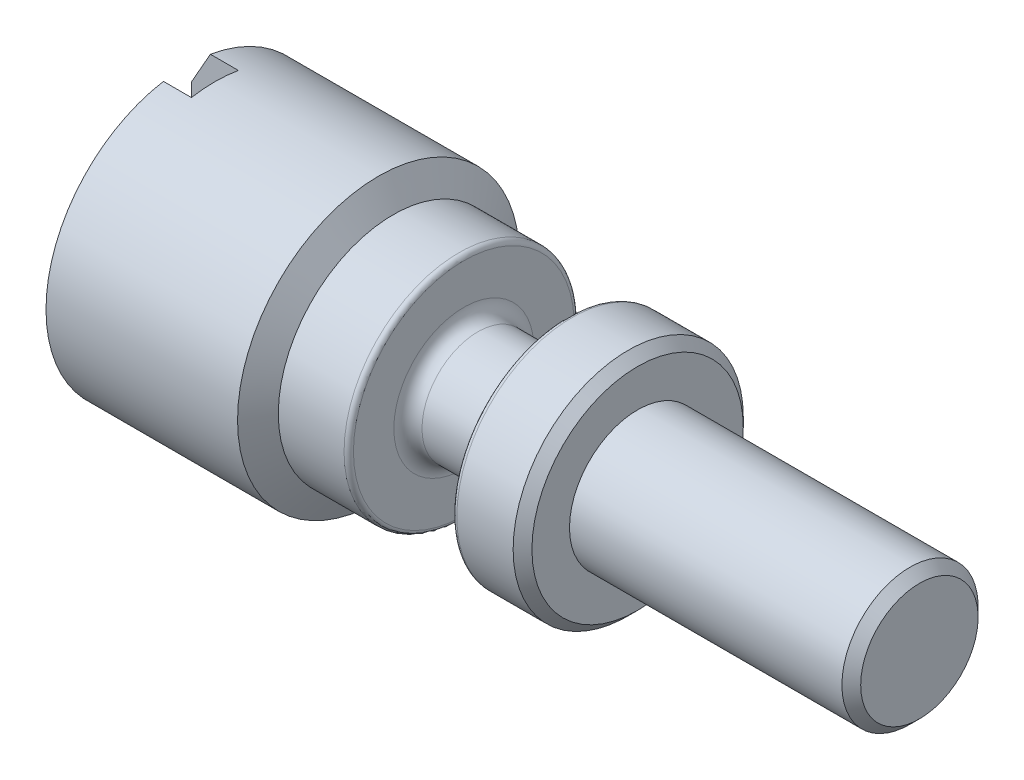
ISO-10303-21;
HEADER;
FILE_DESCRIPTION(('STEP AP214'),'2;1');
FILE_NAME('part.step','',(''),(''),'','','');
FILE_SCHEMA(('AUTOMOTIVE_DESIGN { 1 0 10303 214 1 1 1 1 }'));
ENDSEC;
DATA;
#1=APPLICATION_CONTEXT('core data for automotive mechanical design processes');
#2=APPLICATION_PROTOCOL_DEFINITION('international standard','automotive_design',2000,#1);
#3=PRODUCT_CONTEXT('',#1,'mechanical');
#4=PRODUCT('Part','Part','',(#3));
#5=PRODUCT_RELATED_PRODUCT_CATEGORY('part','',(#4));
#6=PRODUCT_DEFINITION_FORMATION('','',#4);
#7=PRODUCT_DEFINITION_CONTEXT('part definition',#1,'design');
#8=PRODUCT_DEFINITION('design','',#6,#7);
#9=PRODUCT_DEFINITION_SHAPE('','',#8);
#10=(LENGTH_UNIT() NAMED_UNIT(*) SI_UNIT(.MILLI.,.METRE.));
#11=(NAMED_UNIT(*) PLANE_ANGLE_UNIT() SI_UNIT($,.RADIAN.));
#12=(NAMED_UNIT(*) SI_UNIT($,.STERADIAN.) SOLID_ANGLE_UNIT());
#13=UNCERTAINTY_MEASURE_WITH_UNIT(LENGTH_MEASURE(1.E-05),#10,'distance_accuracy_value','');
#14=(GEOMETRIC_REPRESENTATION_CONTEXT(3) GLOBAL_UNCERTAINTY_ASSIGNED_CONTEXT((#13)) GLOBAL_UNIT_ASSIGNED_CONTEXT((#10,
#11,#12)) REPRESENTATION_CONTEXT('',''));
#15=CARTESIAN_POINT('',(0.,0.,0.));
#16=DIRECTION('',(0.,0.,1.));
#17=DIRECTION('',(1.,0.,0.));
#18=AXIS2_PLACEMENT_3D('',#15,#16,#17);
#19=CARTESIAN_POINT('',(0.,2.3,0.));
#20=DIRECTION('',(1.,0.,0.));
#21=DIRECTION('',(0.,0.,-1.00000000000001));
#22=AXIS2_PLACEMENT_3D('',#19,#20,#21);
#23=PLANE('',#22);
#24=CARTESIAN_POINT('',(0.,0.,0.));
#25=DIRECTION('',(-1.,0.,0.));
#26=DIRECTION('',(0.,0.,1.00000000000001));
#27=AXIS2_PLACEMENT_3D('',#24,#25,#26);
#28=CIRCLE('',#27,2.3);
#29=CARTESIAN_POINT('',(0.,2.24499443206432,-0.500000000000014));
#30=VERTEX_POINT('',#29);
#31=CARTESIAN_POINT('',(0.,-2.24499443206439,-0.5));
#32=VERTEX_POINT('',#31);
#33=EDGE_CURVE('E107',#30,#32,#28,.T.);
#34=ORIENTED_EDGE('',*,*,#33,.T.);
#35=DIRECTION('',(0.,1.00000000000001,0.));
#36=VECTOR('',#35,1.);
#37=CARTESIAN_POINT('',(0.,-4.50000000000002,-0.500000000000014));
#38=LINE('',#37,#36);
#39=EDGE_CURVE('E99',#32,#30,#38,.T.);
#40=ORIENTED_EDGE('',*,*,#39,.T.);
#41=EDGE_LOOP('',(#34,#40));
#42=FACE_BOUND('',#41,.T.);
#43=ADVANCED_FACE('F36',(#42),#23,.F.);
#44=CARTESIAN_POINT('',(0.40414518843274,0.,0.));
#45=DIRECTION('',(1.,0.,0.));
#46=DIRECTION('',(0.,0.,-1.00000000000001));
#47=AXIS2_PLACEMENT_3D('',#44,#45,#46);
#48=CONICAL_SURFACE('',#47,3.,1.0471975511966);
#49=CARTESIAN_POINT('',(0.40414518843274,0.,0.));
#50=DIRECTION('',(-1.,0.,0.));
#51=DIRECTION('',(0.,0.,1.00000000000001));
#52=AXIS2_PLACEMENT_3D('',#49,#50,#51);
#53=CIRCLE('',#52,3.);
#54=CARTESIAN_POINT('',(0.40414518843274,2.95803989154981,-0.5));
#55=VERTEX_POINT('',#54);
#56=CARTESIAN_POINT('',(0.40414518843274,-2.95803989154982,-0.5));
#57=VERTEX_POINT('',#56);
#58=EDGE_CURVE('E108',#55,#57,#53,.T.);
#59=ORIENTED_EDGE('',*,*,#58,.T.);
#60=CARTESIAN_POINT('',(2.4983365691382,-6.60835742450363,-0.5));
#61=CARTESIAN_POINT('',(2.33754994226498,-6.32905650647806,-0.500000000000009));
#62=CARTESIAN_POINT('',(2.17679546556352,-6.04973702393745,-0.500000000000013));
#63=CARTESIAN_POINT('',(1.85541884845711,-5.49101933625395,-0.500000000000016));
#64=CARTESIAN_POINT('',(1.69479670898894,-5.21162113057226,-0.500000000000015));
#65=CARTESIAN_POINT('',(1.37362738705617,-4.65248605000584,-0.500000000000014));
#66=CARTESIAN_POINT('',(1.21308036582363,-4.37274908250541,-0.500000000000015));
#67=CARTESIAN_POINT('',(0.892332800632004,-3.81307851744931,-0.500000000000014));
#68=CARTESIAN_POINT('',(0.732132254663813,-3.53314492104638,-0.500000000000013));
#69=CARTESIAN_POINT('',(0.492929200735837,-3.11396046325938,-0.500000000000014));
#70=CARTESIAN_POINT('',(0.413665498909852,-2.97485868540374,-0.500000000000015));
#71=CARTESIAN_POINT('',(0.255397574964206,-2.69650513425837,-0.500000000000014));
#72=CARTESIAN_POINT('',(0.176393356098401,-2.55725335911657,-0.500000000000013));
#73=CARTESIAN_POINT('',(0.0188328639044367,-2.27857581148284,-0.500000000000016));
#74=CARTESIAN_POINT('',(-0.0597235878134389,-2.13915013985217,-0.50000000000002));
#75=CARTESIAN_POINT('',(-0.216137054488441,-1.85991156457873,-0.500000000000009));
#76=CARTESIAN_POINT('',(-0.293994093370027,-1.72009867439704,-0.499999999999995));
#77=CARTESIAN_POINT('',(-0.409961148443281,-1.50940543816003,-0.500000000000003));
#78=CARTESIAN_POINT('',(-0.448588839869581,-1.43881034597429,-0.500000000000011));
#79=CARTESIAN_POINT('',(-0.525315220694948,-1.29732475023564,-0.500000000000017));
#80=CARTESIAN_POINT('',(-0.563413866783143,-1.2264342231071,-0.500000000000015));
#81=CARTESIAN_POINT('',(-0.63881726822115,-1.08412531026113,-0.500000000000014));
#82=CARTESIAN_POINT('',(-0.676121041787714,-1.01270640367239,-0.500000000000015));
#83=CARTESIAN_POINT('',(-0.749323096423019,-0.869156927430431,-0.500000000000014));
#84=CARTESIAN_POINT('',(-0.785221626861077,-0.797026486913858,-0.500000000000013));
#85=CARTESIAN_POINT('',(-0.837549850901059,-0.686867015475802,-0.500000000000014));
#86=CARTESIAN_POINT('',(-0.854960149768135,-0.649306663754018,-0.500000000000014));
#87=CARTESIAN_POINT('',(-0.888745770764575,-0.573725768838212,-0.500000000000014));
#88=CARTESIAN_POINT('',(-0.905121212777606,-0.535705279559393,-0.500000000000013));
#89=CARTESIAN_POINT('',(-0.936339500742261,-0.459031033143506,-0.500000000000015));
#90=CARTESIAN_POINT('',(-0.951182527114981,-0.420377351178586,-0.500000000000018));
#91=CARTESIAN_POINT('',(-0.978536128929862,-0.342270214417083,-0.500000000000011));
#92=CARTESIAN_POINT('',(-0.991047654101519,-0.302817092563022,-0.500000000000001));
#93=CARTESIAN_POINT('',(-1.01648208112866,-0.208025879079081,-0.499999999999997));
#94=CARTESIAN_POINT('',(-1.02784152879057,-0.152215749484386,-0.500000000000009));
#95=CARTESIAN_POINT('',(-1.03702258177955,-0.0678306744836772,-0.500000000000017));
#96=CARTESIAN_POINT('',(-1.03878028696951,-0.0396852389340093,-0.500000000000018));
#97=CARTESIAN_POINT('',(-1.03952744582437,0.0166440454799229,-0.50000000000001));
#98=CARTESIAN_POINT('',(-1.03851695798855,0.0448278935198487,-0.500000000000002));
#99=CARTESIAN_POINT('',(-1.03321049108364,0.10852531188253,-0.499999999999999));
#100=CARTESIAN_POINT('',(-1.02810354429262,0.143970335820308,-0.50000000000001));
#101=CARTESIAN_POINT('',(-1.01444226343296,0.214196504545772,-0.500000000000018));
#102=CARTESIAN_POINT('',(-1.00588391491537,0.248976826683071,-0.500000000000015));
#103=CARTESIAN_POINT('',(-0.986157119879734,0.318273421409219,-0.500000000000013));
#104=CARTESIAN_POINT('',(-0.974955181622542,0.352779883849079,-0.500000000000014));
#105=CARTESIAN_POINT('',(-0.950795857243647,0.421147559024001,-0.500000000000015));
#106=CARTESIAN_POINT('',(-0.937839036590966,0.455008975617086,-0.500000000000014));
#107=CARTESIAN_POINT('',(-0.909399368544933,0.525488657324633,-0.500000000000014));
#108=CARTESIAN_POINT('',(-0.893793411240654,0.562056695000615,-0.500000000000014));
#109=CARTESIAN_POINT('',(-0.86158242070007,0.634752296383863,-0.500000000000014));
#110=CARTESIAN_POINT('',(-0.844977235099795,0.670879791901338,-0.500000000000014));
#111=CARTESIAN_POINT('',(-0.794117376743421,0.778807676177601,-0.500000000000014));
#112=CARTESIAN_POINT('',(-0.758832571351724,0.850120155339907,-0.500000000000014));
#113=CARTESIAN_POINT('',(-0.686767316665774,0.992116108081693,-0.500000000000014));
#114=CARTESIAN_POINT('',(-0.649984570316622,1.06279839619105,-0.500000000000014));
#115=CARTESIAN_POINT('',(-0.575565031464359,1.203684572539,-0.500000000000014));
#116=CARTESIAN_POINT('',(-0.537928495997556,1.27388859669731,-0.500000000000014));
#117=CARTESIAN_POINT('',(-0.462314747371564,1.41362256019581,-0.500000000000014));
#118=CARTESIAN_POINT('',(-0.424340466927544,1.48315409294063,-0.500000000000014));
#119=CARTESIAN_POINT('',(-0.348023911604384,1.6220216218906,-0.500000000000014));
#120=CARTESIAN_POINT('',(-0.309681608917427,1.69135760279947,-0.500000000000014));
#121=CARTESIAN_POINT('',(-0.19435235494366,1.8990197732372,-0.500000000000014));
#122=CARTESIAN_POINT('',(-0.116988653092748,2.03713648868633,-0.500000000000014));
#123=CARTESIAN_POINT('',(0.0647759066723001,2.36016715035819,-0.500000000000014));
#124=CARTESIAN_POINT('',(0.169390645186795,2.54496043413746,-0.500000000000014));
#125=CARTESIAN_POINT('',(0.37912439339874,2.91426301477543,-0.500000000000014));
#126=CARTESIAN_POINT('',(0.484243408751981,3.09877230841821,-0.500000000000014));
#127=CARTESIAN_POINT('',(0.800118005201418,3.65220737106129,-0.500000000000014));
#128=CARTESIAN_POINT('',(1.0113043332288,4.02088713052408,-0.500000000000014));
#129=CARTESIAN_POINT('',(1.43503208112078,4.75953035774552,-0.500000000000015));
#130=CARTESIAN_POINT('',(1.64757546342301,5.12949269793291,-0.500000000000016));
#131=CARTESIAN_POINT('',(2.07284454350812,5.86909697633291,-0.500000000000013));
#132=CARTESIAN_POINT('',(2.28557012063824,6.2387389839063,-0.50000000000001));
#133=CARTESIAN_POINT('',(2.4983365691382,6.60835742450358,-0.500000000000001));
#134=B_SPLINE_CURVE_WITH_KNOTS('',3,(#60,#61,#62,#63,#64,#65,#66,#67,#68,#69,#70,#71,#72,#73,
#74,#75,#76,#77,#78,#79,#80,#81,#82,#83,#84,#85,#86,#87,#88,#89,#90,#91,#92,#93,#94,#95,#96,#97,
#98,#99,#100,#101,#102,#103,#104,#105,#106,#107,#108,#109,#110,#111,#112,#113,#114,#115,#116,
#117,#118,#119,#120,#121,#122,#123,#124,#125,#126,#127,#128,#129,#130,#131,#132,#133),
.UNSPECIFIED.,.F.,.F.,(4,2,2,2,2,2,2,2,2,2,2,2,2,2,2,2,2,2,2,2,2,2,2,2,2,2,2,2,2,2,2,2,2,2,2,2,
4),(0.,0.966825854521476,1.93365849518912,2.90126013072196,3.86885614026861,4.34915627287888,
4.82946240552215,5.30956152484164,5.78964415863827,6.03105935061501,6.27249419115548,
6.51421172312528,6.75588616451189,6.88007299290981,7.00424540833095,7.12840318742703,
7.25251028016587,7.42257675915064,7.50705075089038,7.59152295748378,7.69872713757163,
7.80605637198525,7.91482621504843,8.02356109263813,8.14281580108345,8.26208873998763,
8.50074311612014,8.73977836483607,8.97874258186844,9.21641780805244,9.45411113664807,
9.92903195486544,10.5660826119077,11.2031404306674,12.477784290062,13.7577926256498,
15.0372402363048),.UNSPECIFIED.);
#135=EDGE_CURVE('E59',#57,#32,#134,.T.);
#136=ORIENTED_EDGE('',*,*,#135,.T.);
#137=ORIENTED_EDGE('',*,*,#33,.F.);
#138=EDGE_CURVE('E255',#30,#55,#134,.T.);
#139=ORIENTED_EDGE('',*,*,#138,.T.);
#140=EDGE_LOOP('',(#59,#136,#137,#139));
#141=FACE_BOUND('',#140,.T.);
#142=ADVANCED_FACE('F173',(#141),#48,.T.);
#143=CARTESIAN_POINT('',(-5.4550241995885,0.,0.));
#144=DIRECTION('',(-1.,0.,0.));
#145=DIRECTION('',(0.,0.,1.00000000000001));
#146=AXIS2_PLACEMENT_3D('',#143,#144,#145);
#147=CYLINDRICAL_SURFACE('',#146,1.45);
#148=CARTESIAN_POINT('',(15.8,0.,0.));
#149=DIRECTION('',(-1.,0.,0.));
#150=DIRECTION('',(0.,0.,1.00000000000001));
#151=AXIS2_PLACEMENT_3D('',#148,#149,#150);
#152=CIRCLE('',#151,1.45);
#153=CARTESIAN_POINT('',(15.8,0.,1.45000000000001));
#154=VERTEX_POINT('',#153);
#155=EDGE_CURVE('E111',#154,#154,#152,.T.);
#156=ORIENTED_EDGE('',*,*,#155,.T.);
#157=EDGE_LOOP('',(#156));
#158=FACE_BOUND('',#157,.T.);
#159=CARTESIAN_POINT('',(10.,0.,0.));
#160=DIRECTION('',(-1.,0.,0.));
#161=DIRECTION('',(0.,0.,1.00000000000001));
#162=AXIS2_PLACEMENT_3D('',#159,#160,#161);
#163=CIRCLE('',#162,1.45);
#164=CARTESIAN_POINT('',(10.,0.,1.45000000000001));
#165=VERTEX_POINT('',#164);
#166=EDGE_CURVE('E261',#165,#165,#163,.T.);
#167=ORIENTED_EDGE('',*,*,#166,.F.);
#168=EDGE_LOOP('',(#167));
#169=FACE_BOUND('',#168,.T.);
#170=ADVANCED_FACE('F179',(#158,#169),#147,.T.);
#171=CARTESIAN_POINT('',(16.,1.44999999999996,0.));
#172=DIRECTION('',(-1.,0.,0.));
#173=DIRECTION('',(0.,0.,1.00000000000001));
#174=AXIS2_PLACEMENT_3D('',#171,#172,#173);
#175=PLANE('',#174);
#176=CARTESIAN_POINT('',(16.,0.,0.));
#177=DIRECTION('',(-1.,0.,0.));
#178=DIRECTION('',(0.,0.,1.00000000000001));
#179=AXIS2_PLACEMENT_3D('',#176,#177,#178);
#180=CIRCLE('',#179,1.25);
#181=CARTESIAN_POINT('',(16.,0.,1.25000000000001));
#182=VERTEX_POINT('',#181);
#183=EDGE_CURVE('E119',#182,#182,#180,.F.);
#184=ORIENTED_EDGE('',*,*,#183,.T.);
#185=EDGE_LOOP('',(#184));
#186=FACE_BOUND('',#185,.T.);
#187=ADVANCED_FACE('F184',(#186),#175,.F.);
#188=CARTESIAN_POINT('',(0.,-2.24499443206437,0.500000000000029));
#189=VERTEX_POINT('',#188);
#190=CARTESIAN_POINT('',(0.,2.24499443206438,0.500000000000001));
#191=VERTEX_POINT('',#190);
#192=EDGE_CURVE('E104',#189,#191,#28,.T.);
#193=ORIENTED_EDGE('',*,*,#192,.T.);
#194=DIRECTION('',(0.,1.00000000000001,0.));
#195=VECTOR('',#194,1.);
#196=CARTESIAN_POINT('',(0.,-4.50000000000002,0.500000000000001));
#197=LINE('',#196,#195);
#198=EDGE_CURVE('E90',#189,#191,#197,.T.);
#199=ORIENTED_EDGE('',*,*,#198,.F.);
#200=EDGE_LOOP('',(#193,#199));
#201=FACE_BOUND('',#200,.T.);
#202=ADVANCED_FACE('F103',(#201),#23,.F.);
#203=CARTESIAN_POINT('',(0.40414518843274,-2.95803989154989,0.500000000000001));
#204=VERTEX_POINT('',#203);
#205=CARTESIAN_POINT('',(0.40414518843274,2.95803989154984,0.500000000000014));
#206=VERTEX_POINT('',#205);
#207=EDGE_CURVE('E113',#204,#206,#53,.T.);
#208=ORIENTED_EDGE('',*,*,#207,.T.);
#209=CARTESIAN_POINT('',(2.4983365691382,6.60835742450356,0.500000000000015));
#210=CARTESIAN_POINT('',(2.33754994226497,6.329056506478,0.500000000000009));
#211=CARTESIAN_POINT('',(2.1767954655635,6.04973702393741,0.500000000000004));
#212=CARTESIAN_POINT('',(1.85541884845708,5.49101933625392,0.499999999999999));
#213=CARTESIAN_POINT('',(1.69479670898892,5.21162113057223,0.499999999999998));
#214=CARTESIAN_POINT('',(1.37362738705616,4.65248605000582,0.500000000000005));
#215=CARTESIAN_POINT('',(1.21308036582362,4.37274908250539,0.500000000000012));
#216=CARTESIAN_POINT('',(0.892332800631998,3.81307851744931,0.499999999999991));
#217=CARTESIAN_POINT('',(0.732132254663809,3.53314492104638,0.499999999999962));
#218=CARTESIAN_POINT('',(0.492929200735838,3.11396046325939,0.49999999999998));
#219=CARTESIAN_POINT('',(0.413665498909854,2.97485868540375,0.499999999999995));
#220=CARTESIAN_POINT('',(0.255397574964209,2.69650513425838,0.500000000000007));
#221=CARTESIAN_POINT('',(0.176393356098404,2.55725335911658,0.500000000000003));
#222=CARTESIAN_POINT('',(0.0188328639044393,2.27857581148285,0.5));
#223=CARTESIAN_POINT('',(-0.0597235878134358,2.13915013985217,0.500000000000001));
#224=CARTESIAN_POINT('',(-0.216137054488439,1.85991156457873,0.500000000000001));
#225=CARTESIAN_POINT('',(-0.293994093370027,1.72009867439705,0.5));
#226=CARTESIAN_POINT('',(-0.40996114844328,1.50940543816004,0.500000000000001));
#227=CARTESIAN_POINT('',(-0.448588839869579,1.4388103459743,0.500000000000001));
#228=CARTESIAN_POINT('',(-0.525315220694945,1.29732475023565,0.500000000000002));
#229=CARTESIAN_POINT('',(-0.56341386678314,1.22643422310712,0.500000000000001));
#230=CARTESIAN_POINT('',(-0.638817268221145,1.08412531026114,0.500000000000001));
#231=CARTESIAN_POINT('',(-0.676121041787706,1.01270640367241,0.500000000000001));
#232=CARTESIAN_POINT('',(-0.749323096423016,0.869156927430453,0.500000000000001));
#233=CARTESIAN_POINT('',(-0.78522162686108,0.797026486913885,0.500000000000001));
#234=CARTESIAN_POINT('',(-0.837549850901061,0.686867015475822,0.500000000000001));
#235=CARTESIAN_POINT('',(-0.854960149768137,0.649306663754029,0.500000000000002));
#236=CARTESIAN_POINT('',(-0.88874577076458,0.573725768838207,0.500000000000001));
#237=CARTESIAN_POINT('',(-0.905121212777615,0.535705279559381,0.5));
#238=CARTESIAN_POINT('',(-0.93633950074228,0.45903103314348,0.500000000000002));
#239=CARTESIAN_POINT('',(-0.951182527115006,0.420377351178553,0.500000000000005));
#240=CARTESIAN_POINT('',(-0.978536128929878,0.34227021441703,0.499999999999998));
#241=CARTESIAN_POINT('',(-0.991047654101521,0.302817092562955,0.499999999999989));
#242=CARTESIAN_POINT('',(-1.01648208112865,0.208025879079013,0.499999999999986));
#243=CARTESIAN_POINT('',(-1.02784152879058,0.152215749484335,0.499999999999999));
#244=CARTESIAN_POINT('',(-1.03702258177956,0.0678306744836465,0.500000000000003));
#245=CARTESIAN_POINT('',(-1.03878028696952,0.0396852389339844,0.500000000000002));
#246=CARTESIAN_POINT('',(-1.03952744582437,-0.0166440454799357,0.500000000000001));
#247=CARTESIAN_POINT('',(-1.03851695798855,-0.044827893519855,0.500000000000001));
#248=CARTESIAN_POINT('',(-1.03321049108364,-0.108525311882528,0.500000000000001));
#249=CARTESIAN_POINT('',(-1.02810354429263,-0.143970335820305,0.500000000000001));
#250=CARTESIAN_POINT('',(-1.01444226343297,-0.214196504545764,0.500000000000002));
#251=CARTESIAN_POINT('',(-1.00588391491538,-0.248976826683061,0.500000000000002));
#252=CARTESIAN_POINT('',(-0.986157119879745,-0.318273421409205,0.5));
#253=CARTESIAN_POINT('',(-0.974955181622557,-0.352779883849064,0.499999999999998));
#254=CARTESIAN_POINT('',(-0.950795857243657,-0.42114755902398,0.500000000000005));
#255=CARTESIAN_POINT('',(-0.937839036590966,-0.45500897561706,0.500000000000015));
#256=CARTESIAN_POINT('',(-0.909399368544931,-0.525488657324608,0.500000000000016));
#257=CARTESIAN_POINT('',(-0.893793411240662,-0.562056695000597,0.500000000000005));
#258=CARTESIAN_POINT('',(-0.861582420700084,-0.634752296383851,0.499999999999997));
#259=CARTESIAN_POINT('',(-0.844977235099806,-0.670879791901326,0.5));
#260=CARTESIAN_POINT('',(-0.794117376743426,-0.778807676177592,0.500000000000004));
#261=CARTESIAN_POINT('',(-0.758832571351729,-0.850120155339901,0.500000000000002));
#262=CARTESIAN_POINT('',(-0.686767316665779,-0.992116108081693,0.500000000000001));
#263=CARTESIAN_POINT('',(-0.649984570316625,-1.06279839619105,0.500000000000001));
#264=CARTESIAN_POINT('',(-0.575565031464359,-1.20368457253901,0.500000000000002));
#265=CARTESIAN_POINT('',(-0.537928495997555,-1.27388859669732,0.500000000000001));
#266=CARTESIAN_POINT('',(-0.462314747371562,-1.41362256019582,0.500000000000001));
#267=CARTESIAN_POINT('',(-0.42434046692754,-1.48315409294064,0.500000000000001));
#268=CARTESIAN_POINT('',(-0.348023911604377,-1.62202162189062,0.500000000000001));
#269=CARTESIAN_POINT('',(-0.309681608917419,-1.69135760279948,0.500000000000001));
#270=CARTESIAN_POINT('',(-0.194352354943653,-1.89901977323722,0.500000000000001));
#271=CARTESIAN_POINT('',(-0.116988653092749,-2.03713648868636,0.500000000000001));
#272=CARTESIAN_POINT('',(0.0647759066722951,-2.36016715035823,0.500000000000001));
#273=CARTESIAN_POINT('',(0.169390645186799,-2.54496043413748,0.500000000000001));
#274=CARTESIAN_POINT('',(0.379124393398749,-2.91426301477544,0.500000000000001));
#275=CARTESIAN_POINT('',(0.484243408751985,-3.09877230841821,0.500000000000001));
#276=CARTESIAN_POINT('',(0.800118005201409,-3.65220737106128,0.500000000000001));
#277=CARTESIAN_POINT('',(1.01130433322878,-4.02088713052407,0.500000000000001));
#278=CARTESIAN_POINT('',(1.43503208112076,-4.7595303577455,0.500000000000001));
#279=CARTESIAN_POINT('',(1.647575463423,-5.12949269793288,0.500000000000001));
#280=CARTESIAN_POINT('',(2.07284454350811,-5.86909697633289,0.500000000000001));
#281=CARTESIAN_POINT('',(2.28557012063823,-6.23873898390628,0.500000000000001));
#282=CARTESIAN_POINT('',(2.4983365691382,-6.60835742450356,0.500000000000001));
#283=B_SPLINE_CURVE_WITH_KNOTS('',3,(#209,#210,#211,#212,#213,#214,#215,#216,#217,#218,#219,
#220,#221,#222,#223,#224,#225,#226,#227,#228,#229,#230,#231,#232,#233,#234,#235,#236,#237,#238,
#239,#240,#241,#242,#243,#244,#245,#246,#247,#248,#249,#250,#251,#252,#253,#254,#255,#256,#257,
#258,#259,#260,#261,#262,#263,#264,#265,#266,#267,#268,#269,#270,#271,#272,#273,#274,#275,#276,
#277,#278,#279,#280,#281,#282),.UNSPECIFIED.,.F.,.F.,(4,2,2,2,2,2,2,2,2,2,2,2,2,2,2,2,2,2,2,2,2,
2,2,2,2,2,2,2,2,2,2,2,2,2,2,2,4),(0.,0.966825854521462,1.9336584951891,2.90126013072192,
3.86885614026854,4.34915627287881,4.82946240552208,5.30956152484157,5.78964415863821,
6.03105935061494,6.27249419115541,6.5142117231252,6.75588616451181,6.88007299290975,
7.00424540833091,7.12840318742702,7.25251028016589,7.42257675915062,7.50705075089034,
7.59152295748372,7.69872713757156,7.80605637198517,7.91482621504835,8.02356109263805,
8.14281580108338,8.26208873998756,8.50074311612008,8.73977836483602,8.9787425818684,
9.21641780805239,9.45411113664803,9.92903195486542,10.5660826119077,11.2031404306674,
12.4777842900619,13.7577926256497,15.0372402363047),.UNSPECIFIED.);
#284=EDGE_CURVE('E98',#206,#191,#283,.T.);
#285=ORIENTED_EDGE('',*,*,#284,.T.);
#286=ORIENTED_EDGE('',*,*,#192,.F.);
#287=EDGE_CURVE('E87',#189,#204,#283,.T.);
#288=ORIENTED_EDGE('',*,*,#287,.T.);
#289=EDGE_LOOP('',(#208,#285,#286,#288));
#290=FACE_BOUND('',#289,.T.);
#291=ADVANCED_FACE('F106',(#290),#48,.T.);
#292=CARTESIAN_POINT('',(-5.4550241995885,0.,0.));
#293=DIRECTION('',(-1.,0.,0.));
#294=DIRECTION('',(0.,0.,1.00000000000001));
#295=AXIS2_PLACEMENT_3D('',#292,#293,#294);
#296=CYLINDRICAL_SURFACE('',#295,3.);
#297=ORIENTED_EDGE('',*,*,#58,.F.);
#298=DIRECTION('',(-1.,0.,0.));
#299=VECTOR('',#298,1.);
#300=CARTESIAN_POINT('',(-5.4550241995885,2.95803989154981,-0.5));
#301=LINE('',#300,#299);
#302=CARTESIAN_POINT('',(1.,2.95803989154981,-0.5));
#303=VERTEX_POINT('',#302);
#304=EDGE_CURVE('E150',#55,#303,#301,.F.);
#305=ORIENTED_EDGE('',*,*,#304,.T.);
#306=CARTESIAN_POINT('',(1.,0.,0.));
#307=DIRECTION('',(1.,0.,0.));
#308=DIRECTION('',(0.,0.,-1.00000000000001));
#309=AXIS2_PLACEMENT_3D('',#306,#307,#308);
#310=CIRCLE('',#309,3.);
#311=CARTESIAN_POINT('',(1.,2.95803989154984,0.500000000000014));
#312=VERTEX_POINT('',#311);
#313=EDGE_CURVE('E145',#303,#312,#310,.T.);
#314=ORIENTED_EDGE('',*,*,#313,.T.);
#315=DIRECTION('',(-1.,0.,0.));
#316=VECTOR('',#315,1.);
#317=CARTESIAN_POINT('',(-5.4550241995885,2.95803989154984,0.500000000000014));
#318=LINE('',#317,#316);
#319=EDGE_CURVE('E147',#312,#206,#318,.T.);
#320=ORIENTED_EDGE('',*,*,#319,.T.);
#321=ORIENTED_EDGE('',*,*,#207,.F.);
#322=DIRECTION('',(-1.,0.,0.));
#323=VECTOR('',#322,1.);
#324=CARTESIAN_POINT('',(-5.4550241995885,-2.95803989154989,0.500000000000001));
#325=LINE('',#324,#323);
#326=CARTESIAN_POINT('',(1.,-2.95803989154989,0.500000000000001));
#327=VERTEX_POINT('',#326);
#328=EDGE_CURVE('E93',#204,#327,#325,.F.);
#329=ORIENTED_EDGE('',*,*,#328,.T.);
#330=CARTESIAN_POINT('',(1.,-2.95803989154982,-0.5));
#331=VERTEX_POINT('',#330);
#332=EDGE_CURVE('E141',#327,#331,#310,.T.);
#333=ORIENTED_EDGE('',*,*,#332,.T.);
#334=DIRECTION('',(-1.,0.,0.));
#335=VECTOR('',#334,1.);
#336=CARTESIAN_POINT('',(-5.4550241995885,-2.95803989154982,-0.5));
#337=LINE('',#336,#335);
#338=EDGE_CURVE('E144',#331,#57,#337,.T.);
#339=ORIENTED_EDGE('',*,*,#338,.T.);
#340=EDGE_LOOP('',(#297,#305,#314,#320,#321,#329,#333,#339));
#341=FACE_BOUND('',#340,.T.);
#342=CARTESIAN_POINT('',(4.48245735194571,0.,0.));
#343=DIRECTION('',(-1.,0.,0.));
#344=DIRECTION('',(0.,0.,1.00000000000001));
#345=AXIS2_PLACEMENT_3D('',#342,#343,#344);
#346=CIRCLE('',#345,3.);
#347=CARTESIAN_POINT('',(4.48245735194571,0.,3.00000000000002));
#348=VERTEX_POINT('',#347);
#349=EDGE_CURVE('E366',#348,#348,#346,.T.);
#350=ORIENTED_EDGE('',*,*,#349,.T.);
#351=EDGE_LOOP('',(#350));
#352=FACE_BOUND('',#351,.T.);
#353=ADVANCED_FACE('F189',(#341,#352),#296,.T.);
#354=CARTESIAN_POINT('',(4.8,0.,0.));
#355=DIRECTION('',(-1.,0.,0.));
#356=DIRECTION('',(0.,0.,1.00000000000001));
#357=AXIS2_PLACEMENT_3D('',#354,#355,#356);
#358=CONICAL_SURFACE('',#357,2.45,1.0471975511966);
#359=ORIENTED_EDGE('',*,*,#349,.F.);
#360=EDGE_LOOP('',(#359));
#361=FACE_BOUND('',#360,.T.);
#362=CARTESIAN_POINT('',(4.8,0.,0.));
#363=DIRECTION('',(-1.,0.,0.));
#364=DIRECTION('',(0.,0.,1.00000000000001));
#365=AXIS2_PLACEMENT_3D('',#362,#363,#364);
#366=CIRCLE('',#365,2.45);
#367=CARTESIAN_POINT('',(4.8,0.,2.45000000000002));
#368=VERTEX_POINT('',#367);
#369=EDGE_CURVE('E364',#368,#368,#366,.T.);
#370=ORIENTED_EDGE('',*,*,#369,.T.);
#371=EDGE_LOOP('',(#370));
#372=FACE_BOUND('',#371,.T.);
#373=ADVANCED_FACE('F241',(#361,#372),#358,.T.);
#374=CARTESIAN_POINT('',(-5.4550241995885,0.,0.));
#375=DIRECTION('',(-1.,0.,0.));
#376=DIRECTION('',(0.,0.,1.00000000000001));
#377=AXIS2_PLACEMENT_3D('',#374,#375,#376);
#378=CYLINDRICAL_SURFACE('',#377,2.45);
#379=CARTESIAN_POINT('',(6.2,0.,0.));
#380=DIRECTION('',(-1.,0.,0.));
#381=DIRECTION('',(0.,0.,1.00000000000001));
#382=AXIS2_PLACEMENT_3D('',#379,#380,#381);
#383=CIRCLE('',#382,2.45);
#384=CARTESIAN_POINT('',(6.2,0.,2.45000000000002));
#385=VERTEX_POINT('',#384);
#386=EDGE_CURVE('E153',#385,#385,#383,.T.);
#387=ORIENTED_EDGE('',*,*,#386,.T.);
#388=EDGE_LOOP('',(#387));
#389=FACE_BOUND('',#388,.T.);
#390=ORIENTED_EDGE('',*,*,#369,.F.);
#391=EDGE_LOOP('',(#390));
#392=FACE_BOUND('',#391,.T.);
#393=ADVANCED_FACE('F234',(#389,#392),#378,.T.);
#394=CARTESIAN_POINT('',(6.3,1.19000000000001,0.));
#395=DIRECTION('',(-1.,0.,0.));
#396=DIRECTION('',(0.,0.,1.00000000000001));
#397=AXIS2_PLACEMENT_3D('',#394,#395,#396);
#398=PLANE('',#397);
#399=CARTESIAN_POINT('',(6.3,0.,0.));
#400=DIRECTION('',(-1.,0.,0.));
#401=DIRECTION('',(0.,0.,1.00000000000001));
#402=AXIS2_PLACEMENT_3D('',#399,#400,#401);
#403=CIRCLE('',#402,2.35);
#404=CARTESIAN_POINT('',(6.3,0.,2.35000000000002));
#405=VERTEX_POINT('',#404);
#406=EDGE_CURVE('E156',#405,#405,#403,.F.);
#407=ORIENTED_EDGE('',*,*,#406,.T.);
#408=EDGE_LOOP('',(#407));
#409=FACE_BOUND('',#408,.T.);
#410=CARTESIAN_POINT('',(6.3,0.,0.));
#411=DIRECTION('',(-1.,0.,0.));
#412=DIRECTION('',(0.,0.,1.00000000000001));
#413=AXIS2_PLACEMENT_3D('',#410,#411,#412);
#414=CIRCLE('',#413,1.49);
#415=CARTESIAN_POINT('',(6.3,0.,1.49000000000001));
#416=VERTEX_POINT('',#415);
#417=EDGE_CURVE('E128',#416,#416,#414,.T.);
#418=ORIENTED_EDGE('',*,*,#417,.T.);
#419=EDGE_LOOP('',(#418));
#420=FACE_BOUND('',#419,.T.);
#421=ADVANCED_FACE('F225',(#409,#420),#398,.F.);
#422=CARTESIAN_POINT('',(-5.4550241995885,0.,0.));
#423=DIRECTION('',(-1.,0.,0.));
#424=DIRECTION('',(0.,0.,1.00000000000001));
#425=AXIS2_PLACEMENT_3D('',#422,#423,#424);
#426=CYLINDRICAL_SURFACE('',#425,1.19);
#427=CARTESIAN_POINT('',(6.6,0.,0.));
#428=DIRECTION('',(-1.,0.,0.));
#429=DIRECTION('',(0.,0.,1.00000000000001));
#430=AXIS2_PLACEMENT_3D('',#427,#428,#429);
#431=CIRCLE('',#430,1.19);
#432=CARTESIAN_POINT('',(6.6,0.,1.19000000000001));
#433=VERTEX_POINT('',#432);
#434=EDGE_CURVE('E134',#433,#433,#431,.F.);
#435=ORIENTED_EDGE('',*,*,#434,.T.);
#436=EDGE_LOOP('',(#435));
#437=FACE_BOUND('',#436,.T.);
#438=CARTESIAN_POINT('',(8.2,0.,0.));
#439=DIRECTION('',(1.,0.,0.));
#440=DIRECTION('',(0.,0.,-1.00000000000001));
#441=AXIS2_PLACEMENT_3D('',#438,#439,#440);
#442=CIRCLE('',#441,1.19);
#443=CARTESIAN_POINT('',(8.2,0.,-1.19000000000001));
#444=VERTEX_POINT('',#443);
#445=EDGE_CURVE('E131',#444,#444,#442,.F.);
#446=ORIENTED_EDGE('',*,*,#445,.T.);
#447=EDGE_LOOP('',(#446));
#448=FACE_BOUND('',#447,.T.);
#449=ADVANCED_FACE('F223',(#437,#448),#426,.T.);
#450=CARTESIAN_POINT('',(8.5,2.45000000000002,0.));
#451=DIRECTION('',(1.,0.,0.));
#452=DIRECTION('',(0.,0.,-1.00000000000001));
#453=AXIS2_PLACEMENT_3D('',#450,#451,#452);
#454=PLANE('',#453);
#455=CARTESIAN_POINT('',(8.5,0.,0.));
#456=DIRECTION('',(1.,0.,0.));
#457=DIRECTION('',(0.,0.,-1.00000000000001));
#458=AXIS2_PLACEMENT_3D('',#455,#456,#457);
#459=CIRCLE('',#458,2.35);
#460=CARTESIAN_POINT('',(8.5,0.,-2.35000000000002));
#461=VERTEX_POINT('',#460);
#462=EDGE_CURVE('E44',#461,#461,#459,.F.);
#463=ORIENTED_EDGE('',*,*,#462,.T.);
#464=EDGE_LOOP('',(#463));
#465=FACE_BOUND('',#464,.T.);
#466=CARTESIAN_POINT('',(8.5,0.,0.));
#467=DIRECTION('',(1.,0.,0.));
#468=DIRECTION('',(0.,0.,-1.00000000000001));
#469=AXIS2_PLACEMENT_3D('',#466,#467,#468);
#470=CIRCLE('',#469,1.49);
#471=CARTESIAN_POINT('',(8.5,0.,-1.49000000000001));
#472=VERTEX_POINT('',#471);
#473=EDGE_CURVE('E137',#472,#472,#470,.T.);
#474=ORIENTED_EDGE('',*,*,#473,.T.);
#475=EDGE_LOOP('',(#474));
#476=FACE_BOUND('',#475,.T.);
#477=ADVANCED_FACE('F161',(#465,#476),#454,.F.);
#478=CARTESIAN_POINT('',(-5.4550241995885,0.,0.));
#479=DIRECTION('',(-1.,0.,0.));
#480=DIRECTION('',(0.,0.,1.00000000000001));
#481=AXIS2_PLACEMENT_3D('',#478,#479,#480);
#482=CYLINDRICAL_SURFACE('',#481,2.45);
#483=CARTESIAN_POINT('',(8.6,0.,0.));
#484=DIRECTION('',(1.,0.,0.));
#485=DIRECTION('',(0.,0.,-1.00000000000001));
#486=AXIS2_PLACEMENT_3D('',#483,#484,#485);
#487=CIRCLE('',#486,2.45);
#488=CARTESIAN_POINT('',(8.6,0.,-2.45000000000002));
#489=VERTEX_POINT('',#488);
#490=EDGE_CURVE('E11',#489,#489,#487,.T.);
#491=ORIENTED_EDGE('',*,*,#490,.T.);
#492=EDGE_LOOP('',(#491));
#493=FACE_BOUND('',#492,.T.);
#494=CARTESIAN_POINT('',(9.8,0.,0.));
#495=DIRECTION('',(-1.,0.,0.));
#496=DIRECTION('',(0.,0.,1.00000000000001));
#497=AXIS2_PLACEMENT_3D('',#494,#495,#496);
#498=CIRCLE('',#497,2.45);
#499=CARTESIAN_POINT('',(9.8,0.,2.45000000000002));
#500=VERTEX_POINT('',#499);
#501=EDGE_CURVE('E122',#500,#500,#498,.T.);
#502=ORIENTED_EDGE('',*,*,#501,.T.);
#503=EDGE_LOOP('',(#502));
#504=FACE_BOUND('',#503,.T.);
#505=ADVANCED_FACE('F232',(#493,#504),#482,.T.);
#506=CARTESIAN_POINT('',(10.,1.44999999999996,0.));
#507=DIRECTION('',(-1.,0.,0.));
#508=DIRECTION('',(0.,0.,1.00000000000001));
#509=AXIS2_PLACEMENT_3D('',#506,#507,#508);
#510=PLANE('',#509);
#511=CARTESIAN_POINT('',(10.,0.,0.));
#512=DIRECTION('',(-1.,0.,0.));
#513=DIRECTION('',(0.,0.,1.00000000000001));
#514=AXIS2_PLACEMENT_3D('',#511,#512,#513);
#515=CIRCLE('',#514,2.25);
#516=CARTESIAN_POINT('',(10.,0.,2.25000000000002));
#517=VERTEX_POINT('',#516);
#518=EDGE_CURVE('E125',#517,#517,#515,.F.);
#519=ORIENTED_EDGE('',*,*,#518,.T.);
#520=EDGE_LOOP('',(#519));
#521=FACE_BOUND('',#520,.T.);
#522=ORIENTED_EDGE('',*,*,#166,.T.);
#523=EDGE_LOOP('',(#522));
#524=FACE_BOUND('',#523,.T.);
#525=ADVANCED_FACE('F201',(#521,#524),#510,.F.);
#526=CARTESIAN_POINT('',(15.8,0.,0.));
#527=DIRECTION('',(-1.,0.,0.));
#528=DIRECTION('',(0.,0.,1.00000000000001));
#529=AXIS2_PLACEMENT_3D('',#526,#527,#528);
#530=CONICAL_SURFACE('',#529,1.45,0.785398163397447);
#531=ORIENTED_EDGE('',*,*,#183,.F.);
#532=EDGE_LOOP('',(#531));
#533=FACE_BOUND('',#532,.T.);
#534=ORIENTED_EDGE('',*,*,#155,.F.);
#535=EDGE_LOOP('',(#534));
#536=FACE_BOUND('',#535,.T.);
#537=ADVANCED_FACE('F197',(#533,#536),#530,.T.);
#538=CARTESIAN_POINT('',(9.8,0.,0.));
#539=DIRECTION('',(-1.,0.,0.));
#540=DIRECTION('',(0.,0.,1.00000000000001));
#541=AXIS2_PLACEMENT_3D('',#538,#539,#540);
#542=CONICAL_SURFACE('',#541,2.45,0.785398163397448);
#543=ORIENTED_EDGE('',*,*,#518,.F.);
#544=EDGE_LOOP('',(#543));
#545=FACE_BOUND('',#544,.T.);
#546=ORIENTED_EDGE('',*,*,#501,.F.);
#547=EDGE_LOOP('',(#546));
#548=FACE_BOUND('',#547,.T.);
#549=ADVANCED_FACE('F200',(#545,#548),#542,.T.);
#550=CARTESIAN_POINT('',(6.6,0.,0.));
#551=DIRECTION('',(-1.,0.,0.));
#552=DIRECTION('',(0.,0.,1.00000000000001));
#553=AXIS2_PLACEMENT_3D('',#550,#551,#552);
#554=TOROIDAL_SURFACE('',#553,1.49,0.3);
#555=ORIENTED_EDGE('',*,*,#434,.F.);
#556=EDGE_LOOP('',(#555));
#557=FACE_BOUND('',#556,.T.);
#558=ORIENTED_EDGE('',*,*,#417,.F.);
#559=EDGE_LOOP('',(#558));
#560=FACE_BOUND('',#559,.T.);
#561=ADVANCED_FACE('F205',(#557,#560),#554,.F.);
#562=CARTESIAN_POINT('',(8.2,0.,0.));
#563=DIRECTION('',(1.,0.,0.));
#564=DIRECTION('',(0.,0.,-1.00000000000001));
#565=AXIS2_PLACEMENT_3D('',#562,#563,#564);
#566=TOROIDAL_SURFACE('',#565,1.49,0.3);
#567=ORIENTED_EDGE('',*,*,#473,.F.);
#568=EDGE_LOOP('',(#567));
#569=FACE_BOUND('',#568,.T.);
#570=ORIENTED_EDGE('',*,*,#445,.F.);
#571=EDGE_LOOP('',(#570));
#572=FACE_BOUND('',#571,.T.);
#573=ADVANCED_FACE('F209',(#569,#572),#566,.F.);
#574=CARTESIAN_POINT('',(0.,-4.50000000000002,-0.500000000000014));
#575=DIRECTION('',(0.,0.,-1.00000000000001));
#576=DIRECTION('',(-1.,0.,0.));
#577=AXIS2_PLACEMENT_3D('',#574,#575,#576);
#578=PLANE('',#577);
#579=ORIENTED_EDGE('',*,*,#338,.F.);
#580=DIRECTION('',(0.,1.00000000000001,0.));
#581=VECTOR('',#580,1.);
#582=CARTESIAN_POINT('',(1.,-4.50000000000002,-0.500000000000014));
#583=LINE('',#582,#581);
#584=EDGE_CURVE('E370',#331,#303,#583,.T.);
#585=ORIENTED_EDGE('',*,*,#584,.T.);
#586=ORIENTED_EDGE('',*,*,#304,.F.);
#587=ORIENTED_EDGE('',*,*,#138,.F.);
#588=ORIENTED_EDGE('',*,*,#39,.F.);
#589=ORIENTED_EDGE('',*,*,#135,.F.);
#590=EDGE_LOOP('',(#579,#585,#586,#587,#588,#589));
#591=FACE_BOUND('',#590,.T.);
#592=ADVANCED_FACE('F212',(#591),#578,.F.);
#593=CARTESIAN_POINT('',(1.,-4.50000000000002,-0.500000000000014));
#594=DIRECTION('',(1.,0.,0.));
#595=DIRECTION('',(0.,0.,-1.00000000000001));
#596=AXIS2_PLACEMENT_3D('',#593,#594,#595);
#597=PLANE('',#596);
#598=ORIENTED_EDGE('',*,*,#584,.F.);
#599=ORIENTED_EDGE('',*,*,#332,.F.);
#600=DIRECTION('',(0.,1.00000000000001,0.));
#601=VECTOR('',#600,1.);
#602=CARTESIAN_POINT('',(1.,-4.50000000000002,0.500000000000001));
#603=LINE('',#602,#601);
#604=EDGE_CURVE('E51',#327,#312,#603,.T.);
#605=ORIENTED_EDGE('',*,*,#604,.T.);
#606=ORIENTED_EDGE('',*,*,#313,.F.);
#607=EDGE_LOOP('',(#598,#599,#605,#606));
#608=FACE_BOUND('',#607,.T.);
#609=ADVANCED_FACE('F217',(#608),#597,.F.);
#610=CARTESIAN_POINT('',(0.,-4.50000000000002,0.500000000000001));
#611=DIRECTION('',(0.,0.,1.00000000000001));
#612=DIRECTION('',(1.,0.,0.));
#613=AXIS2_PLACEMENT_3D('',#610,#611,#612);
#614=PLANE('',#613);
#615=ORIENTED_EDGE('',*,*,#319,.F.);
#616=ORIENTED_EDGE('',*,*,#604,.F.);
#617=ORIENTED_EDGE('',*,*,#328,.F.);
#618=ORIENTED_EDGE('',*,*,#287,.F.);
#619=ORIENTED_EDGE('',*,*,#198,.T.);
#620=ORIENTED_EDGE('',*,*,#284,.F.);
#621=EDGE_LOOP('',(#615,#616,#617,#618,#619,#620));
#622=FACE_BOUND('',#621,.T.);
#623=ADVANCED_FACE('F89',(#622),#614,.F.);
#624=CARTESIAN_POINT('',(6.2,0.,0.));
#625=DIRECTION('',(-1.,0.,0.));
#626=DIRECTION('',(0.,0.,1.00000000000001));
#627=AXIS2_PLACEMENT_3D('',#624,#625,#626);
#628=TOROIDAL_SURFACE('',#627,2.35,0.1);
#629=ORIENTED_EDGE('',*,*,#406,.F.);
#630=EDGE_LOOP('',(#629));
#631=FACE_BOUND('',#630,.T.);
#632=ORIENTED_EDGE('',*,*,#386,.F.);
#633=EDGE_LOOP('',(#632));
#634=FACE_BOUND('',#633,.T.);
#635=ADVANCED_FACE('F165',(#631,#634),#628,.T.);
#636=CARTESIAN_POINT('',(8.6,0.,0.));
#637=DIRECTION('',(1.,0.,0.));
#638=DIRECTION('',(0.,0.,-1.00000000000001));
#639=AXIS2_PLACEMENT_3D('',#636,#637,#638);
#640=TOROIDAL_SURFACE('',#639,2.35,0.1);
#641=ORIENTED_EDGE('',*,*,#490,.F.);
#642=EDGE_LOOP('',(#641));
#643=FACE_BOUND('',#642,.T.);
#644=ORIENTED_EDGE('',*,*,#462,.F.);
#645=EDGE_LOOP('',(#644));
#646=FACE_BOUND('',#645,.T.);
#647=ADVANCED_FACE('F38',(#643,#646),#640,.T.);
#648=CLOSED_SHELL('',(#43,#142,#170,#187,#202,#291,#353,#373,#393,#421,#449,#477,#505,#525,#537,
#549,#561,#573,#592,#609,#623,#635,#647));
#649=MANIFOLD_SOLID_BREP('B2',#648);
#650=ADVANCED_BREP_SHAPE_REPRESENTATION('',(#18,#649),#14);
#651=SHAPE_DEFINITION_REPRESENTATION(#9,#650);
ENDSEC;
END-ISO-10303-21;
